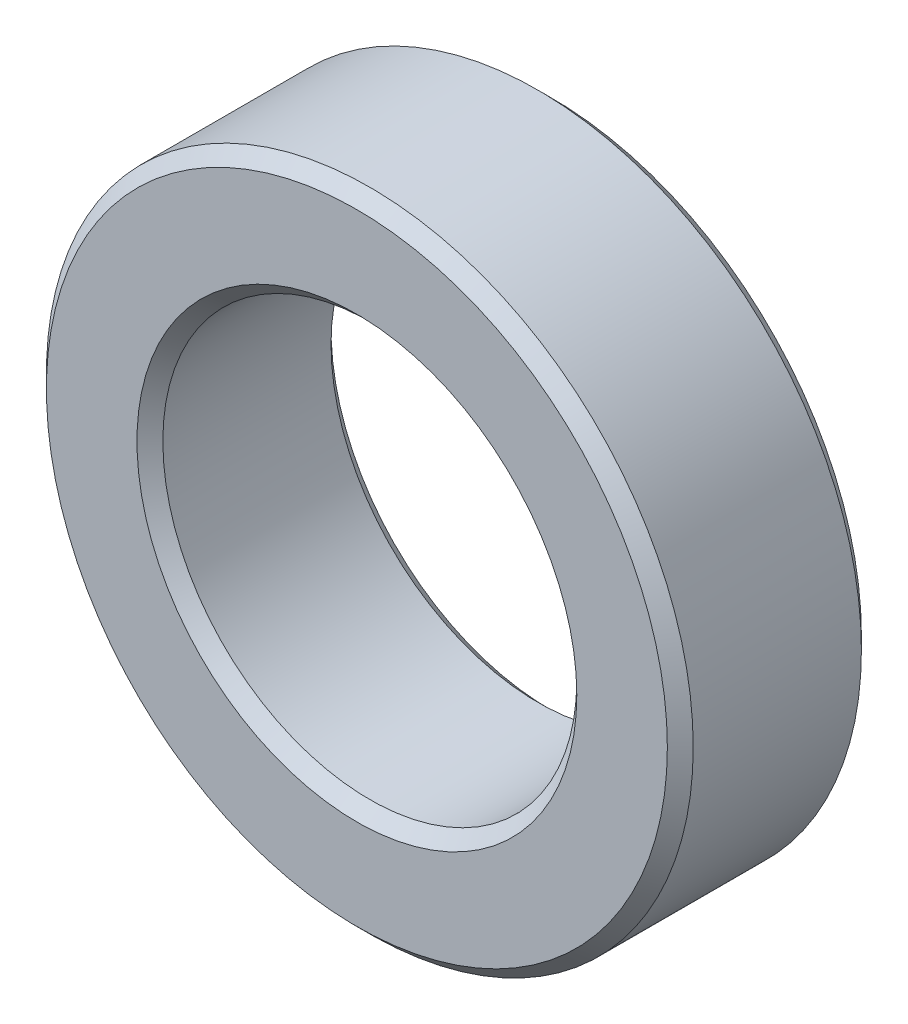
ISO-10303-21;
HEADER;
FILE_DESCRIPTION(('STEP AP214'),'2;1');
FILE_NAME('part.step','',(''),(''),'','','');
FILE_SCHEMA(('AUTOMOTIVE_DESIGN { 1 0 10303 214 1 1 1 1 }'));
ENDSEC;
DATA;
#1=APPLICATION_CONTEXT('core data for automotive mechanical design processes');
#2=APPLICATION_PROTOCOL_DEFINITION('international standard','automotive_design',2000,#1);
#3=PRODUCT_CONTEXT('',#1,'mechanical');
#4=PRODUCT('Part','Part','',(#3));
#5=PRODUCT_RELATED_PRODUCT_CATEGORY('part','',(#4));
#6=PRODUCT_DEFINITION_FORMATION('','',#4);
#7=PRODUCT_DEFINITION_CONTEXT('part definition',#1,'design');
#8=PRODUCT_DEFINITION('design','',#6,#7);
#9=PRODUCT_DEFINITION_SHAPE('','',#8);
#10=(LENGTH_UNIT() NAMED_UNIT(*) SI_UNIT(.MILLI.,.METRE.));
#11=(NAMED_UNIT(*) PLANE_ANGLE_UNIT() SI_UNIT($,.RADIAN.));
#12=(NAMED_UNIT(*) SI_UNIT($,.STERADIAN.) SOLID_ANGLE_UNIT());
#13=UNCERTAINTY_MEASURE_WITH_UNIT(LENGTH_MEASURE(1.E-05),#10,'distance_accuracy_value','');
#14=(GEOMETRIC_REPRESENTATION_CONTEXT(3) GLOBAL_UNCERTAINTY_ASSIGNED_CONTEXT((#13)) GLOBAL_UNIT_ASSIGNED_CONTEXT((#10,
#11,#12)) REPRESENTATION_CONTEXT('',''));
#15=CARTESIAN_POINT('',(0.,0.,0.));
#16=DIRECTION('',(0.,0.,1.));
#17=DIRECTION('',(1.,0.,0.));
#18=AXIS2_PLACEMENT_3D('',#15,#16,#17);
#19=CARTESIAN_POINT('',(0.,0.,1.5));
#20=DIRECTION('',(0.,0.,1.));
#21=DIRECTION('',(1.,0.,0.));
#22=AXIS2_PLACEMENT_3D('',#19,#20,#21);
#23=PLANE('',#22);
#24=CARTESIAN_POINT('',(0.,0.,1.5));
#25=DIRECTION('',(0.,0.,1.));
#26=DIRECTION('',(1.,0.,0.));
#27=AXIS2_PLACEMENT_3D('',#24,#25,#26);
#28=CIRCLE('',#27,3.4);
#29=CARTESIAN_POINT('',(3.4,0.,1.5));
#30=VERTEX_POINT('',#29);
#31=EDGE_CURVE('E10',#30,#30,#28,.F.);
#32=ORIENTED_EDGE('',*,*,#31,.T.);
#33=EDGE_LOOP('',(#32));
#34=FACE_BOUND('',#33,.T.);
#35=CARTESIAN_POINT('',(0.,0.,1.5));
#36=DIRECTION('',(0.,0.,1.));
#37=DIRECTION('',(1.,0.,0.));
#38=AXIS2_PLACEMENT_3D('',#35,#36,#37);
#39=CIRCLE('',#38,4.8);
#40=CARTESIAN_POINT('',(4.8,0.,1.5));
#41=VERTEX_POINT('',#40);
#42=EDGE_CURVE('E45',#41,#41,#39,.T.);
#43=ORIENTED_EDGE('',*,*,#42,.T.);
#44=EDGE_LOOP('',(#43));
#45=FACE_BOUND('',#44,.T.);
#46=ADVANCED_FACE('F37',(#34,#45),#23,.T.);
#47=CARTESIAN_POINT('',(0.,0.,-1.5));
#48=DIRECTION('',(0.,0.,1.));
#49=DIRECTION('',(1.,0.,0.));
#50=AXIS2_PLACEMENT_3D('',#47,#48,#49);
#51=PLANE('',#50);
#52=CARTESIAN_POINT('',(0.,0.,-1.5));
#53=DIRECTION('',(0.,0.,1.));
#54=DIRECTION('',(1.,0.,0.));
#55=AXIS2_PLACEMENT_3D('',#52,#53,#54);
#56=CIRCLE('',#55,4.8);
#57=CARTESIAN_POINT('',(4.8,0.,-1.5));
#58=VERTEX_POINT('',#57);
#59=EDGE_CURVE('E62',#58,#58,#56,.F.);
#60=ORIENTED_EDGE('',*,*,#59,.T.);
#61=EDGE_LOOP('',(#60));
#62=FACE_BOUND('',#61,.T.);
#63=CARTESIAN_POINT('',(0.,0.,-1.5));
#64=DIRECTION('',(0.,0.,1.));
#65=DIRECTION('',(1.,0.,0.));
#66=AXIS2_PLACEMENT_3D('',#63,#64,#65);
#67=CIRCLE('',#66,3.4);
#68=CARTESIAN_POINT('',(3.4,0.,-1.5));
#69=VERTEX_POINT('',#68);
#70=EDGE_CURVE('E66',#69,#69,#67,.T.);
#71=ORIENTED_EDGE('',*,*,#70,.T.);
#72=EDGE_LOOP('',(#71));
#73=FACE_BOUND('',#72,.T.);
#74=ADVANCED_FACE('F89',(#62,#73),#51,.F.);
#75=CARTESIAN_POINT('',(0.,0.,1.5));
#76=DIRECTION('',(0.,0.,-1.));
#77=DIRECTION('',(-1.,0.,0.));
#78=AXIS2_PLACEMENT_3D('',#75,#76,#77);
#79=CYLINDRICAL_SURFACE('',#78,5.);
#80=CARTESIAN_POINT('',(0.,0.,-1.3));
#81=DIRECTION('',(0.,0.,1.));
#82=DIRECTION('',(1.,0.,0.));
#83=AXIS2_PLACEMENT_3D('',#80,#81,#82);
#84=CIRCLE('',#83,5.);
#85=CARTESIAN_POINT('',(5.,0.,-1.3));
#86=VERTEX_POINT('',#85);
#87=EDGE_CURVE('E70',#86,#86,#84,.T.);
#88=ORIENTED_EDGE('',*,*,#87,.T.);
#89=EDGE_LOOP('',(#88));
#90=FACE_BOUND('',#89,.T.);
#91=CARTESIAN_POINT('',(0.,0.,1.3));
#92=DIRECTION('',(0.,0.,1.));
#93=DIRECTION('',(1.,0.,0.));
#94=AXIS2_PLACEMENT_3D('',#91,#92,#93);
#95=CIRCLE('',#94,5.);
#96=CARTESIAN_POINT('',(5.,0.,1.3));
#97=VERTEX_POINT('',#96);
#98=EDGE_CURVE('E73',#97,#97,#95,.F.);
#99=ORIENTED_EDGE('',*,*,#98,.T.);
#100=EDGE_LOOP('',(#99));
#101=FACE_BOUND('',#100,.T.);
#102=ADVANCED_FACE('F78',(#90,#101),#79,.T.);
#103=CARTESIAN_POINT('',(0.,0.,1.5));
#104=DIRECTION('',(0.,0.,-1.));
#105=DIRECTION('',(-1.,0.,0.));
#106=AXIS2_PLACEMENT_3D('',#103,#104,#105);
#107=CYLINDRICAL_SURFACE('',#106,3.2);
#108=CARTESIAN_POINT('',(0.,0.,-1.3));
#109=DIRECTION('',(0.,0.,1.));
#110=DIRECTION('',(1.,0.,0.));
#111=AXIS2_PLACEMENT_3D('',#108,#109,#110);
#112=CIRCLE('',#111,3.2);
#113=CARTESIAN_POINT('',(3.2,0.,-1.3));
#114=VERTEX_POINT('',#113);
#115=EDGE_CURVE('E51',#114,#114,#112,.F.);
#116=ORIENTED_EDGE('',*,*,#115,.T.);
#117=EDGE_LOOP('',(#116));
#118=FACE_BOUND('',#117,.T.);
#119=CARTESIAN_POINT('',(0.,0.,1.3));
#120=DIRECTION('',(0.,0.,1.));
#121=DIRECTION('',(1.,0.,0.));
#122=AXIS2_PLACEMENT_3D('',#119,#120,#121);
#123=CIRCLE('',#122,3.2);
#124=CARTESIAN_POINT('',(3.2,0.,1.3));
#125=VERTEX_POINT('',#124);
#126=EDGE_CURVE('E56',#125,#125,#123,.T.);
#127=ORIENTED_EDGE('',*,*,#126,.T.);
#128=EDGE_LOOP('',(#127));
#129=FACE_BOUND('',#128,.T.);
#130=ADVANCED_FACE('F97',(#118,#129),#107,.F.);
#131=CARTESIAN_POINT('',(0.,0.,-1.3));
#132=DIRECTION('',(0.,0.,1.));
#133=DIRECTION('',(1.,0.,0.));
#134=AXIS2_PLACEMENT_3D('',#131,#132,#133);
#135=CONICAL_SURFACE('',#134,5.,0.785398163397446);
#136=ORIENTED_EDGE('',*,*,#59,.F.);
#137=EDGE_LOOP('',(#136));
#138=FACE_BOUND('',#137,.T.);
#139=ORIENTED_EDGE('',*,*,#87,.F.);
#140=EDGE_LOOP('',(#139));
#141=FACE_BOUND('',#140,.T.);
#142=ADVANCED_FACE('F102',(#138,#141),#135,.T.);
#143=CARTESIAN_POINT('',(0.,0.,-1.5));
#144=DIRECTION('',(0.,0.,-1.));
#145=DIRECTION('',(-1.,0.,0.));
#146=AXIS2_PLACEMENT_3D('',#143,#144,#145);
#147=CONICAL_SURFACE('',#146,3.4,0.785398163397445);
#148=ORIENTED_EDGE('',*,*,#115,.F.);
#149=EDGE_LOOP('',(#148));
#150=FACE_BOUND('',#149,.T.);
#151=ORIENTED_EDGE('',*,*,#70,.F.);
#152=EDGE_LOOP('',(#151));
#153=FACE_BOUND('',#152,.T.);
#154=ADVANCED_FACE('F86',(#150,#153),#147,.F.);
#155=CARTESIAN_POINT('',(0.,0.,1.3));
#156=DIRECTION('',(0.,0.,1.));
#157=DIRECTION('',(1.,0.,0.));
#158=AXIS2_PLACEMENT_3D('',#155,#156,#157);
#159=CONICAL_SURFACE('',#158,3.2,0.785398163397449);
#160=ORIENTED_EDGE('',*,*,#31,.F.);
#161=EDGE_LOOP('',(#160));
#162=FACE_BOUND('',#161,.T.);
#163=ORIENTED_EDGE('',*,*,#126,.F.);
#164=EDGE_LOOP('',(#163));
#165=FACE_BOUND('',#164,.T.);
#166=ADVANCED_FACE('F82',(#162,#165),#159,.F.);
#167=CARTESIAN_POINT('',(0.,0.,1.5));
#168=DIRECTION('',(0.,0.,-1.));
#169=DIRECTION('',(-1.,0.,0.));
#170=AXIS2_PLACEMENT_3D('',#167,#168,#169);
#171=CONICAL_SURFACE('',#170,4.8,0.785398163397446);
#172=ORIENTED_EDGE('',*,*,#98,.F.);
#173=EDGE_LOOP('',(#172));
#174=FACE_BOUND('',#173,.T.);
#175=ORIENTED_EDGE('',*,*,#42,.F.);
#176=EDGE_LOOP('',(#175));
#177=FACE_BOUND('',#176,.T.);
#178=ADVANCED_FACE('F39',(#174,#177),#171,.T.);
#179=CLOSED_SHELL('',(#46,#74,#102,#130,#142,#154,#166,#178));
#180=MANIFOLD_SOLID_BREP('B2',#179);
#181=ADVANCED_BREP_SHAPE_REPRESENTATION('',(#18,#180),#14);
#182=SHAPE_DEFINITION_REPRESENTATION(#9,#181);
ENDSEC;
END-ISO-10303-21;
